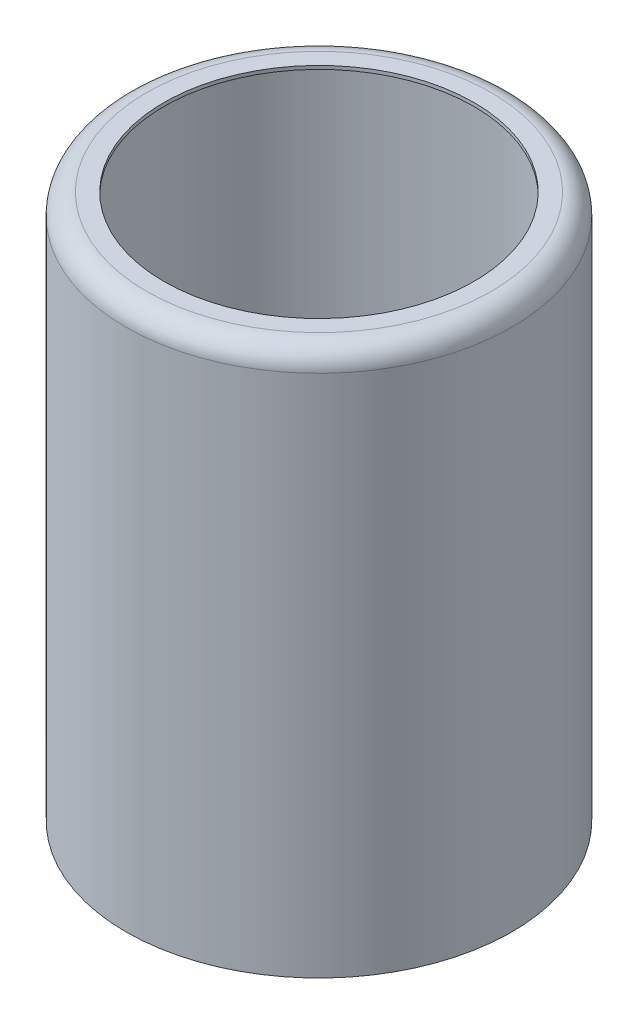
from build123d import *


with BuildPart() as part:
    # Esquisse1 → R_volution1 (revolve)
    with BuildSketch(Plane.XY, mode=Mode.PRIVATE) as r_volution1_sk:
        with BuildLine():
            Line((5, 0), (4.5, 0))
            Line((4.5, 0), (4.5, 0.1))
            Line((4.5, 0.1), (5, 0.1))
            ThreePointArc((5, 0.1), (5.424264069, -0.075735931), (5.6, -0.5))
            Line((5.6, -0.5), (5.6, -15.7))
            Line((5.6, -15.7), (4.5, -15.7))
            Line((4.5, -15.7), (4.5, -15.6))
            Line((4.5, -15.6), (5.5, -15.6))
            Line((5.5, -15.6), (5.5, -0.5))
            ThreePointArc((5.5, -0.5), (5.353553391, -0.146446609), (5, 0))
        make_face()
    revolve(r_volution1_sk.sketch.rotate(Axis((0, 7.982825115, 0), (0, -1, 0)), 90), axis=Axis((0, 7.982825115, 0), (0, -1, 0)))


solid = part.part
